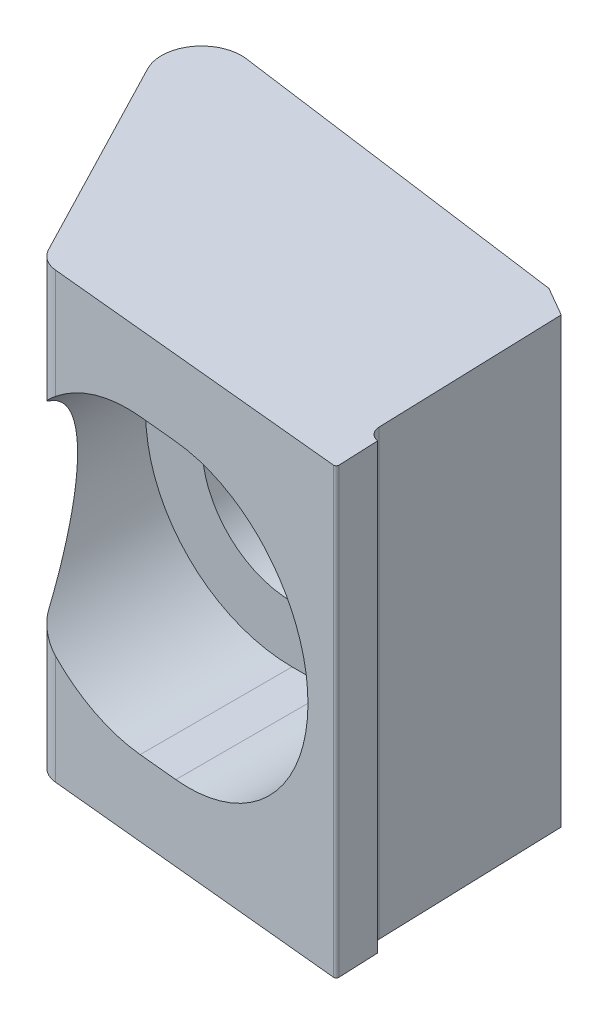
ISO-10303-21;
HEADER;
FILE_DESCRIPTION(('STEP AP214'),'2;1');
FILE_NAME('part.step','',(''),(''),'','','');
FILE_SCHEMA(('AUTOMOTIVE_DESIGN { 1 0 10303 214 1 1 1 1 }'));
ENDSEC;
DATA;
#1=APPLICATION_CONTEXT('core data for automotive mechanical design processes');
#2=APPLICATION_PROTOCOL_DEFINITION('international standard','automotive_design',2000,#1);
#3=PRODUCT_CONTEXT('',#1,'mechanical');
#4=PRODUCT('Part','Part','',(#3));
#5=PRODUCT_RELATED_PRODUCT_CATEGORY('part','',(#4));
#6=PRODUCT_DEFINITION_FORMATION('','',#4);
#7=PRODUCT_DEFINITION_CONTEXT('part definition',#1,'design');
#8=PRODUCT_DEFINITION('design','',#6,#7);
#9=PRODUCT_DEFINITION_SHAPE('','',#8);
#10=(LENGTH_UNIT() NAMED_UNIT(*) SI_UNIT(.MILLI.,.METRE.));
#11=(NAMED_UNIT(*) PLANE_ANGLE_UNIT() SI_UNIT($,.RADIAN.));
#12=(NAMED_UNIT(*) SI_UNIT($,.STERADIAN.) SOLID_ANGLE_UNIT());
#13=UNCERTAINTY_MEASURE_WITH_UNIT(LENGTH_MEASURE(1.E-05),#10,'distance_accuracy_value','');
#14=(GEOMETRIC_REPRESENTATION_CONTEXT(3) GLOBAL_UNCERTAINTY_ASSIGNED_CONTEXT((#13)) GLOBAL_UNIT_ASSIGNED_CONTEXT((#10,
#11,#12)) REPRESENTATION_CONTEXT('',''));
#15=CARTESIAN_POINT('',(0.,0.,0.));
#16=DIRECTION('',(0.,0.,1.));
#17=DIRECTION('',(1.,0.,0.));
#18=AXIS2_PLACEMENT_3D('',#15,#16,#17);
#19=CARTESIAN_POINT('',(-7.493,12.7,14.44498));
#20=DIRECTION('',(0.,-1.,0.));
#21=DIRECTION('',(1.,0.,0.));
#22=AXIS2_PLACEMENT_3D('',#19,#20,#21);
#23=CYLINDRICAL_SURFACE('',#22,1.524);
#24=DIRECTION('',(0.,-1.,0.));
#25=VECTOR('',#24,1.);
#26=CARTESIAN_POINT('',(-8.8454878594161,12.7,15.1473706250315));
#27=LINE('',#26,#25);
#28=CARTESIAN_POINT('',(-8.8454878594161,12.7,15.1473706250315));
#29=VERTEX_POINT('',#28);
#30=CARTESIAN_POINT('',(-8.8454878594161,5.18624872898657,15.1473706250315));
#31=VERTEX_POINT('',#30);
#32=EDGE_CURVE('E314',#29,#31,#27,.T.);
#33=ORIENTED_EDGE('',*,*,#32,.T.);
#34=CARTESIAN_POINT('',(-8.8454878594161,5.18624872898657,15.1473706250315));
#35=CARTESIAN_POINT('',(-8.81941307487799,5.21937150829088,15.1975027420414));
#36=CARTESIAN_POINT('',(-8.79124789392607,5.25460411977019,15.2449958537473));
#37=CARTESIAN_POINT('',(-8.73137862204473,5.32814622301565,15.3348842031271));
#38=CARTESIAN_POINT('',(-8.6996839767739,5.36644742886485,15.3772924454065));
#39=CARTESIAN_POINT('',(-8.6333369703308,5.44507142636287,15.4573517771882));
#40=CARTESIAN_POINT('',(-8.59869206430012,5.4853890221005,15.4950142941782));
#41=CARTESIAN_POINT('',(-8.52669325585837,5.5674933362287,15.5659672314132));
#42=CARTESIAN_POINT('',(-8.48933712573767,5.60928124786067,15.5992539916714));
#43=CARTESIAN_POINT('',(-8.40601788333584,5.70054040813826,15.6665700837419));
#44=CARTESIAN_POINT('',(-8.35963421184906,5.75017081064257,15.6998653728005));
#45=CARTESIAN_POINT('',(-8.26391263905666,5.85004025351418,15.7608424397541));
#46=CARTESIAN_POINT('',(-8.21457277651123,5.900279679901,15.788520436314));
#47=CARTESIAN_POINT('',(-8.06252363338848,6.05110302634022,15.8630601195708));
#48=CARTESIAN_POINT('',(-7.95566187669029,6.15192805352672,15.9015257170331));
#49=CARTESIAN_POINT('',(-7.81133381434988,6.28086894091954,15.9357567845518));
#50=CARTESIAN_POINT('',(-7.77756966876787,6.31054801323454,15.942575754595));
#51=CARTESIAN_POINT('',(-7.70943741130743,6.36946662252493,15.953926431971));
#52=CARTESIAN_POINT('',(-7.67507108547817,6.39870709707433,15.9584640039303));
#53=CARTESIAN_POINT('',(-7.6403832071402,6.42774117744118,15.9618366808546));
#54=B_SPLINE_CURVE_WITH_KNOTS('',3,(#34,#35,#36,#37,#38,#39,#40,#41,#42,#43,#44,#45,#46,#47,#48,
#49,#50,#51,#52,#53),.UNSPECIFIED.,.F.,.F.,(4,2,2,2,2,2,2,2,2,4),(0.,0.196205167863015,
0.391897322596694,0.587108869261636,0.782482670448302,1.00913033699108,1.23593007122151,
1.68891243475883,1.82527813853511,1.96129148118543),.UNSPECIFIED.);
#55=CARTESIAN_POINT('',(-7.64038320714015,6.42774117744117,15.9618366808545));
#56=VERTEX_POINT('',#55);
#57=EDGE_CURVE('E206',#31,#56,#54,.T.);
#58=ORIENTED_EDGE('',*,*,#57,.T.);
#59=DIRECTION('',(0.,-1.,0.));
#60=VECTOR('',#59,1.);
#61=CARTESIAN_POINT('',(-7.64038320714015,12.7,15.9618366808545));
#62=LINE('',#61,#60);
#63=CARTESIAN_POINT('',(-7.64038320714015,12.7,15.9618366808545));
#64=VERTEX_POINT('',#63);
#65=EDGE_CURVE('E310',#64,#56,#62,.T.);
#66=ORIENTED_EDGE('',*,*,#65,.F.);
#67=CARTESIAN_POINT('',(-7.493,12.7,14.44498));
#68=DIRECTION('',(0.,1.,0.));
#69=DIRECTION('',(-1.,0.,0.));
#70=AXIS2_PLACEMENT_3D('',#67,#68,#69);
#71=CIRCLE('',#70,1.524);
#72=EDGE_CURVE('E277',#29,#64,#71,.T.);
#73=ORIENTED_EDGE('',*,*,#72,.F.);
#74=EDGE_LOOP('',(#33,#58,#66,#73));
#75=FACE_BOUND('',#74,.T.);
#76=ADVANCED_FACE('F16',(#75),#23,.T.);
#77=CARTESIAN_POINT('',(7.40664,12.7,2.7432));
#78=DIRECTION('',(-0.134559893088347,0.,0.990905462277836));
#79=DIRECTION('',(0.990905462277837,0.,0.134559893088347));
#80=AXIS2_PLACEMENT_3D('',#77,#78,#79);
#81=PLANE('',#80);
#82=DIRECTION('',(-0.990905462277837,0.,-0.134559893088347));
#83=VECTOR('',#82,1.);
#84=CARTESIAN_POINT('',(7.40664,5.1562,2.7432));
#85=LINE('',#84,#83);
#86=CARTESIAN_POINT('',(0.,5.1562,1.7374161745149));
#87=VERTEX_POINT('',#86);
#88=CARTESIAN_POINT('',(-2.2606,5.1562,1.4304382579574));
#89=VERTEX_POINT('',#88);
#90=EDGE_CURVE('E184',#87,#89,#85,.T.);
#91=ORIENTED_EDGE('',*,*,#90,.T.);
#92=CARTESIAN_POINT('',(-2.2606,0.,1.4304382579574));
#93=DIRECTION('',(-0.134559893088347,0.,0.990905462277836));
#94=DIRECTION('',(0.990905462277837,0.,0.134559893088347));
#95=AXIS2_PLACEMENT_3D('',#92,#93,#94);
#96=ELLIPSE('',#95,5.2035236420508,5.1562);
#97=CARTESIAN_POINT('',(-2.2606,-5.1562,1.4304382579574));
#98=VERTEX_POINT('',#97);
#99=EDGE_CURVE('E187',#89,#98,#96,.T.);
#100=ORIENTED_EDGE('',*,*,#99,.T.);
#101=DIRECTION('',(0.990905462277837,0.,0.134559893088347));
#102=VECTOR('',#101,1.);
#103=CARTESIAN_POINT('',(7.40664,-5.1562,2.7432));
#104=LINE('',#103,#102);
#105=CARTESIAN_POINT('',(0.,-5.1562,1.7374161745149));
#106=VERTEX_POINT('',#105);
#107=EDGE_CURVE('E179',#98,#106,#104,.T.);
#108=ORIENTED_EDGE('',*,*,#107,.T.);
#109=CARTESIAN_POINT('',(0.,0.,1.7374161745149));
#110=DIRECTION('',(-0.134559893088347,0.,0.990905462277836));
#111=DIRECTION('',(0.990905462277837,0.,0.134559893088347));
#112=AXIS2_PLACEMENT_3D('',#109,#110,#111);
#113=ELLIPSE('',#112,5.2035236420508,5.1562);
#114=EDGE_CURVE('E159',#106,#87,#113,.T.);
#115=ORIENTED_EDGE('',*,*,#114,.T.);
#116=EDGE_LOOP('',(#91,#100,#108,#115));
#117=FACE_BOUND('',#116,.T.);
#118=DIRECTION('',(-0.990905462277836,0.,-0.134559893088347));
#119=VECTOR('',#118,1.);
#120=CARTESIAN_POINT('',(7.40664,-12.7,2.7432));
#121=LINE('',#120,#119);
#122=CARTESIAN_POINT('',(7.40664,-12.7,2.7432));
#123=VERTEX_POINT('',#122);
#124=CARTESIAN_POINT('',(-12.6413160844,-12.7,0.0207901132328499));
#125=VERTEX_POINT('',#124);
#126=EDGE_CURVE('E247',#123,#125,#121,.T.);
#127=ORIENTED_EDGE('',*,*,#126,.T.);
#128=DIRECTION('',(0.,-1.,0.));
#129=VECTOR('',#128,1.);
#130=CARTESIAN_POINT('',(-12.6413160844,12.7,0.0207901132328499));
#131=LINE('',#130,#129);
#132=CARTESIAN_POINT('',(-12.6413160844,12.7,0.0207901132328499));
#133=VERTEX_POINT('',#132);
#134=EDGE_CURVE('E320',#133,#125,#131,.T.);
#135=ORIENTED_EDGE('',*,*,#134,.F.);
#136=DIRECTION('',(-0.990905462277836,0.,-0.134559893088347));
#137=VECTOR('',#136,1.);
#138=CARTESIAN_POINT('',(7.40664,12.7,2.7432));
#139=LINE('',#138,#137);
#140=CARTESIAN_POINT('',(7.40664,12.7,2.7432));
#141=VERTEX_POINT('',#140);
#142=EDGE_CURVE('E270',#141,#133,#139,.T.);
#143=ORIENTED_EDGE('',*,*,#142,.F.);
#144=DIRECTION('',(0.,-1.,0.));
#145=VECTOR('',#144,1.);
#146=CARTESIAN_POINT('',(7.40664,12.7,2.7432));
#147=LINE('',#146,#145);
#148=EDGE_CURVE('E291',#141,#123,#147,.T.);
#149=ORIENTED_EDGE('',*,*,#148,.T.);
#150=EDGE_LOOP('',(#127,#135,#143,#149));
#151=FACE_BOUND('',#150,.T.);
#152=ADVANCED_FACE('F18',(#117,#151),#81,.F.);
#153=CARTESIAN_POINT('',(-12.94892,12.7,2.286));
#154=DIRECTION('',(0.,-1.,0.));
#155=DIRECTION('',(1.,0.,0.));
#156=AXIS2_PLACEMENT_3D('',#153,#154,#155);
#157=CYLINDRICAL_SURFACE('',#156,2.286);
#158=CARTESIAN_POINT('',(-12.94892,-12.7,2.286));
#159=DIRECTION('',(0.,1.,0.));
#160=DIRECTION('',(-1.,0.,0.));
#161=AXIS2_PLACEMENT_3D('',#158,#159,#160);
#162=CIRCLE('',#161,2.286);
#163=CARTESIAN_POINT('',(-14.9776517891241,-12.7,3.33958593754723));
#164=VERTEX_POINT('',#163);
#165=EDGE_CURVE('E250',#125,#164,#162,.T.);
#166=ORIENTED_EDGE('',*,*,#165,.T.);
#167=DIRECTION('',(0.,-1.,0.));
#168=VECTOR('',#167,1.);
#169=CARTESIAN_POINT('',(-14.9776517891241,12.7,3.33958593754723));
#170=LINE('',#169,#168);
#171=CARTESIAN_POINT('',(-14.9776517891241,12.7,3.33958593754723));
#172=VERTEX_POINT('',#171);
#173=EDGE_CURVE('E317',#172,#164,#170,.T.);
#174=ORIENTED_EDGE('',*,*,#173,.F.);
#175=CARTESIAN_POINT('',(-12.94892,12.7,2.286));
#176=DIRECTION('',(0.,1.,0.));
#177=DIRECTION('',(-1.,0.,0.));
#178=AXIS2_PLACEMENT_3D('',#175,#176,#177);
#179=CIRCLE('',#178,2.286);
#180=EDGE_CURVE('E273',#133,#172,#179,.T.);
#181=ORIENTED_EDGE('',*,*,#180,.F.);
#182=ORIENTED_EDGE('',*,*,#134,.T.);
#183=EDGE_LOOP('',(#166,#174,#181,#182));
#184=FACE_BOUND('',#183,.T.);
#185=ADVANCED_FACE('F370',(#184),#157,.T.);
#186=CARTESIAN_POINT('',(-8.8454878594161,12.7,15.1473706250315));
#187=DIRECTION('',(0.887459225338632,0.,-0.460886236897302));
#188=DIRECTION('',(-0.460886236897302,0.,-0.887459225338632));
#189=AXIS2_PLACEMENT_3D('',#186,#187,#188);
#190=PLANE('',#189);
#191=CARTESIAN_POINT('',(-8.8454878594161,-5.18624872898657,15.1473706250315));
#192=VERTEX_POINT('',#191);
#193=CARTESIAN_POINT('',(-8.8454878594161,-12.7,15.1473706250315));
#194=VERTEX_POINT('',#193);
#195=EDGE_CURVE('E313',#192,#194,#27,.T.);
#196=ORIENTED_EDGE('',*,*,#195,.F.);
#197=CARTESIAN_POINT('',(-2.2606,0.,27.8268976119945));
#198=DIRECTION('',(0.887459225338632,0.,-0.460886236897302));
#199=DIRECTION('',(0.460886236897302,0.,0.887459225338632));
#200=AXIS2_PLACEMENT_3D('',#197,#198,#199);
#201=ELLIPSE('',#200,18.1867005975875,8.382);
#202=EDGE_CURVE('E222',#192,#31,#201,.T.);
#203=ORIENTED_EDGE('',*,*,#202,.T.);
#204=ORIENTED_EDGE('',*,*,#32,.F.);
#205=DIRECTION('',(0.460886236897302,0.,0.887459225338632));
#206=VECTOR('',#205,1.);
#207=CARTESIAN_POINT('',(-8.8454878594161,12.7,15.1473706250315));
#208=LINE('',#207,#206);
#209=EDGE_CURVE('E275',#172,#29,#208,.T.);
#210=ORIENTED_EDGE('',*,*,#209,.F.);
#211=ORIENTED_EDGE('',*,*,#173,.T.);
#212=DIRECTION('',(0.460886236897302,0.,0.887459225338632));
#213=VECTOR('',#212,1.);
#214=CARTESIAN_POINT('',(-8.8454878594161,-12.7,15.1473706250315));
#215=LINE('',#214,#213);
#216=EDGE_CURVE('E252',#164,#194,#215,.T.);
#217=ORIENTED_EDGE('',*,*,#216,.T.);
#218=EDGE_LOOP('',(#196,#203,#204,#210,#211,#217));
#219=FACE_BOUND('',#218,.T.);
#220=ADVANCED_FACE('F343',(#219),#190,.F.);
#221=CARTESIAN_POINT('',(-7.64038320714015,-6.42774117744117,15.9618366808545));
#222=VERTEX_POINT('',#221);
#223=CARTESIAN_POINT('',(-7.64038320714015,-12.7,15.9618366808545));
#224=VERTEX_POINT('',#223);
#225=EDGE_CURVE('E309',#222,#224,#62,.T.);
#226=ORIENTED_EDGE('',*,*,#225,.F.);
#227=CARTESIAN_POINT('',(-7.64038320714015,-6.42774117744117,15.9618366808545));
#228=CARTESIAN_POINT('',(-7.6893859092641,-6.38673008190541,15.9570669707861));
#229=CARTESIAN_POINT('',(-7.73775178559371,-6.34529333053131,15.9499796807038));
#230=CARTESIAN_POINT('',(-7.83303250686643,-6.26178337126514,15.9313564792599));
#231=CARTESIAN_POINT('',(-7.8799477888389,-6.21971036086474,15.9198219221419));
#232=CARTESIAN_POINT('',(-8.0193465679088,-6.09185761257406,15.8785090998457));
#233=CARTESIAN_POINT('',(-8.10935923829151,-6.00538719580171,15.8421375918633));
#234=CARTESIAN_POINT('',(-8.24512719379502,-5.8692741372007,15.7716433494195));
#235=CARTESIAN_POINT('',(-8.29360406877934,-5.81940382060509,15.7429814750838));
#236=CARTESIAN_POINT('',(-8.38757613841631,-5.72037855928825,15.6800928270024));
#237=CARTESIAN_POINT('',(-8.43307275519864,-5.67122328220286,15.6458687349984));
#238=CARTESIAN_POINT('',(-8.52050435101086,-5.57456239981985,15.571953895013));
#239=CARTESIAN_POINT('',(-8.56245905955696,-5.52704866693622,15.5322971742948));
#240=CARTESIAN_POINT('',(-8.64265166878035,-5.43425165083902,15.4471248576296));
#241=CARTESIAN_POINT('',(-8.68089359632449,-5.38896597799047,15.4016157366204));
#242=CARTESIAN_POINT('',(-8.74036008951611,-5.31714006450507,15.3214556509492));
#243=CARTESIAN_POINT('',(-8.76283737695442,-5.28961126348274,15.2886193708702));
#244=CARTESIAN_POINT('',(-8.80576186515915,-5.23640740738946,15.2201318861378));
#245=CARTESIAN_POINT('',(-8.82620570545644,-5.21073543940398,15.1844761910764));
#246=CARTESIAN_POINT('',(-8.8454878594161,-5.18624872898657,15.1473706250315));
#247=B_SPLINE_CURVE_WITH_KNOTS('',3,(#227,#228,#229,#230,#231,#232,#233,#234,#235,#236,#237,
#238,#239,#240,#241,#242,#243,#244,#245,#246),.UNSPECIFIED.,.F.,.F.,(4,2,2,2,2,2,2,2,2,4),(0.,
0.192108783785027,0.384159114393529,0.772634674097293,0.998095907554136,1.22344875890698,
1.44744967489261,1.67120486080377,1.81621942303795,1.96146978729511),.UNSPECIFIED.);
#248=EDGE_CURVE('E240',#222,#192,#247,.T.);
#249=ORIENTED_EDGE('',*,*,#248,.T.);
#250=ORIENTED_EDGE('',*,*,#195,.T.);
#251=CARTESIAN_POINT('',(-7.493,-12.7,14.44498));
#252=DIRECTION('',(0.,1.,0.));
#253=DIRECTION('',(-1.,0.,0.));
#254=AXIS2_PLACEMENT_3D('',#251,#252,#253);
#255=CIRCLE('',#254,1.524);
#256=EDGE_CURVE('E255',#194,#224,#255,.T.);
#257=ORIENTED_EDGE('',*,*,#256,.T.);
#258=EDGE_LOOP('',(#226,#249,#250,#257));
#259=FACE_BOUND('',#258,.T.);
#260=ADVANCED_FACE('F224',(#259),#23,.T.);
#261=CARTESIAN_POINT('',(9.99286167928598,12.7,17.6751456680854));
#262=DIRECTION('',(0.0967081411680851,0.,-0.995312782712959));
#263=DIRECTION('',(-0.995312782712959,0.,-0.0967081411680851));
#264=AXIS2_PLACEMENT_3D('',#261,#262,#263);
#265=PLANE('',#264);
#266=DIRECTION('',(-0.995312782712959,0.,-0.0967081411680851));
#267=VECTOR('',#266,1.);
#268=CARTESIAN_POINT('',(9.99286167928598,-8.382,17.6751456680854));
#269=LINE('',#268,#267);
#270=CARTESIAN_POINT('',(0.,-8.382,16.7042035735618));
#271=VERTEX_POINT('',#270);
#272=CARTESIAN_POINT('',(-2.2606,-8.382,16.4845556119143));
#273=VERTEX_POINT('',#272);
#274=EDGE_CURVE('E323',#271,#273,#269,.T.);
#275=ORIENTED_EDGE('',*,*,#274,.T.);
#276=CARTESIAN_POINT('',(-2.2606,0.,16.4845556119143));
#277=DIRECTION('',(0.0967081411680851,0.,-0.995312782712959));
#278=DIRECTION('',(0.995312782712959,0.,0.0967081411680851));
#279=AXIS2_PLACEMENT_3D('',#276,#277,#278);
#280=ELLIPSE('',#279,8.42147327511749,8.382);
#281=EDGE_CURVE('E11',#273,#222,#280,.T.);
#282=ORIENTED_EDGE('',*,*,#281,.T.);
#283=ORIENTED_EDGE('',*,*,#225,.T.);
#284=DIRECTION('',(0.995312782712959,0.,0.0967081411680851));
#285=VECTOR('',#284,1.);
#286=CARTESIAN_POINT('',(9.99286167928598,-12.7,17.6751456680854));
#287=LINE('',#286,#285);
#288=CARTESIAN_POINT('',(9.99286167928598,-12.7,17.6751456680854));
#289=VERTEX_POINT('',#288);
#290=EDGE_CURVE('E258',#224,#289,#287,.T.);
#291=ORIENTED_EDGE('',*,*,#290,.T.);
#292=DIRECTION('',(0.,-1.,0.));
#293=VECTOR('',#292,1.);
#294=CARTESIAN_POINT('',(9.99286167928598,12.7,17.6751456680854));
#295=LINE('',#294,#293);
#296=CARTESIAN_POINT('',(9.99286167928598,12.7,17.6751456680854));
#297=VERTEX_POINT('',#296);
#298=EDGE_CURVE('E306',#297,#289,#295,.T.);
#299=ORIENTED_EDGE('',*,*,#298,.F.);
#300=DIRECTION('',(0.995312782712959,0.,0.0967081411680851));
#301=VECTOR('',#300,1.);
#302=CARTESIAN_POINT('',(9.99286167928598,12.7,17.6751456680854));
#303=LINE('',#302,#301);
#304=EDGE_CURVE('E279',#64,#297,#303,.T.);
#305=ORIENTED_EDGE('',*,*,#304,.F.);
#306=ORIENTED_EDGE('',*,*,#65,.T.);
#307=CARTESIAN_POINT('',(-2.2606,8.382,16.4845556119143));
#308=VERTEX_POINT('',#307);
#309=EDGE_CURVE('E20',#56,#308,#280,.T.);
#310=ORIENTED_EDGE('',*,*,#309,.T.);
#311=DIRECTION('',(0.995312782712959,0.,0.0967081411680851));
#312=VECTOR('',#311,1.);
#313=CARTESIAN_POINT('',(9.99286167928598,8.382,17.6751456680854));
#314=LINE('',#313,#312);
#315=CARTESIAN_POINT('',(0.,8.382,16.7042035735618));
#316=VERTEX_POINT('',#315);
#317=EDGE_CURVE('E328',#308,#316,#314,.T.);
#318=ORIENTED_EDGE('',*,*,#317,.T.);
#319=CARTESIAN_POINT('',(0.,0.,16.7042035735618));
#320=DIRECTION('',(0.0967081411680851,0.,-0.995312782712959));
#321=DIRECTION('',(0.995312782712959,0.,0.0967081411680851));
#322=AXIS2_PLACEMENT_3D('',#319,#320,#321);
#323=ELLIPSE('',#322,8.42147327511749,8.382);
#324=EDGE_CURVE('E326',#316,#271,#323,.T.);
#325=ORIENTED_EDGE('',*,*,#324,.T.);
#326=EDGE_LOOP('',(#275,#282,#283,#291,#299,#305,#306,#310,#318,#325));
#327=FACE_BOUND('',#326,.T.);
#328=ADVANCED_FACE('F332',(#327),#265,.F.);
#329=CARTESIAN_POINT('',(10.0076,12.7,17.52346));
#330=DIRECTION('',(0.,-1.,0.));
#331=DIRECTION('',(1.,0.,0.));
#332=AXIS2_PLACEMENT_3D('',#329,#330,#331);
#333=CYLINDRICAL_SURFACE('',#332,0.1524);
#334=CARTESIAN_POINT('',(10.0076,-12.7,17.52346));
#335=DIRECTION('',(0.,1.,0.));
#336=DIRECTION('',(-1.,0.,0.));
#337=AXIS2_PLACEMENT_3D('',#334,#335,#336);
#338=CIRCLE('',#337,0.1524);
#339=CARTESIAN_POINT('',(10.1598606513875,-12.7,17.5169443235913));
#340=VERTEX_POINT('',#339);
#341=EDGE_CURVE('E260',#289,#340,#338,.T.);
#342=ORIENTED_EDGE('',*,*,#341,.T.);
#343=DIRECTION('',(0.,-1.,0.));
#344=VECTOR('',#343,1.);
#345=CARTESIAN_POINT('',(10.1598606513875,12.7,17.5169443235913));
#346=LINE('',#345,#344);
#347=CARTESIAN_POINT('',(10.1598606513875,12.7,17.5169443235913));
#348=VERTEX_POINT('',#347);
#349=EDGE_CURVE('E303',#348,#340,#346,.T.);
#350=ORIENTED_EDGE('',*,*,#349,.F.);
#351=CARTESIAN_POINT('',(10.0076,12.7,17.52346));
#352=DIRECTION('',(0.,1.,0.));
#353=DIRECTION('',(-1.,0.,0.));
#354=AXIS2_PLACEMENT_3D('',#351,#352,#353);
#355=CIRCLE('',#354,0.1524);
#356=EDGE_CURVE('E281',#297,#348,#355,.T.);
#357=ORIENTED_EDGE('',*,*,#356,.F.);
#358=ORIENTED_EDGE('',*,*,#298,.T.);
#359=EDGE_LOOP('',(#342,#350,#357,#358));
#360=FACE_BOUND('',#359,.T.);
#361=ADVANCED_FACE('F378',(#360),#333,.T.);
#362=CARTESIAN_POINT('',(10.1598606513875,12.7,17.5169443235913));
#363=DIRECTION('',(-0.999085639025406,0.,0.0427537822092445));
#364=DIRECTION('',(0.0427537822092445,0.,0.999085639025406));
#365=AXIS2_PLACEMENT_3D('',#362,#363,#364);
#366=PLANE('',#365);
#367=DIRECTION('',(-0.0427537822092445,0.,-0.999085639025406));
#368=VECTOR('',#367,1.);
#369=CARTESIAN_POINT('',(10.1598606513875,-12.7,17.5169443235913));
#370=LINE('',#369,#368);
#371=CARTESIAN_POINT('',(10.0610433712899,-12.7,15.2077468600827));
#372=VERTEX_POINT('',#371);
#373=EDGE_CURVE('E262',#340,#372,#370,.T.);
#374=ORIENTED_EDGE('',*,*,#373,.T.);
#375=DIRECTION('',(0.,-1.,0.));
#376=VECTOR('',#375,1.);
#377=CARTESIAN_POINT('',(10.0610433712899,12.7,15.2077468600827));
#378=LINE('',#377,#376);
#379=CARTESIAN_POINT('',(10.0610433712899,12.7,15.2077468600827));
#380=VERTEX_POINT('',#379);
#381=EDGE_CURVE('E300',#380,#372,#378,.T.);
#382=ORIENTED_EDGE('',*,*,#381,.F.);
#383=DIRECTION('',(-0.0427537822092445,0.,-0.999085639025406));
#384=VECTOR('',#383,1.);
#385=CARTESIAN_POINT('',(10.1598606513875,12.7,17.5169443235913));
#386=LINE('',#385,#384);
#387=EDGE_CURVE('E283',#348,#380,#386,.T.);
#388=ORIENTED_EDGE('',*,*,#387,.F.);
#389=ORIENTED_EDGE('',*,*,#349,.T.);
#390=EDGE_LOOP('',(#374,#382,#388,#389));
#391=FACE_BOUND('',#390,.T.);
#392=ADVANCED_FACE('F400',(#391),#366,.F.);
#393=CARTESIAN_POINT('',(10.18032,12.7,14.45514));
#394=DIRECTION('',(0.,-1.,0.));
#395=DIRECTION('',(1.,0.,0.));
#396=AXIS2_PLACEMENT_3D('',#393,#394,#395);
#397=CYLINDRICAL_SURFACE('',#396,0.762);
#398=CARTESIAN_POINT('',(10.18032,-12.7,14.45514));
#399=DIRECTION('',(0.,-1.,0.));
#400=DIRECTION('',(-1.,0.,0.));
#401=AXIS2_PLACEMENT_3D('',#398,#399,#400);
#402=CIRCLE('',#401,0.762);
#403=CARTESIAN_POINT('',(9.41871805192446,-12.7,14.4797666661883));
#404=VERTEX_POINT('',#403);
#405=EDGE_CURVE('E264',#372,#404,#402,.T.);
#406=ORIENTED_EDGE('',*,*,#405,.T.);
#407=DIRECTION('',(0.,-1.,0.));
#408=VECTOR('',#407,1.);
#409=CARTESIAN_POINT('',(9.41871805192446,12.7,14.4797666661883));
#410=LINE('',#409,#408);
#411=CARTESIAN_POINT('',(9.41871805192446,12.7,14.4797666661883));
#412=VERTEX_POINT('',#411);
#413=EDGE_CURVE('E297',#412,#404,#410,.T.);
#414=ORIENTED_EDGE('',*,*,#413,.F.);
#415=CARTESIAN_POINT('',(10.18032,12.7,14.45514));
#416=DIRECTION('',(0.,-1.,0.));
#417=DIRECTION('',(-1.,0.,0.));
#418=AXIS2_PLACEMENT_3D('',#415,#416,#417);
#419=CIRCLE('',#418,0.762);
#420=EDGE_CURVE('E285',#380,#412,#419,.T.);
#421=ORIENTED_EDGE('',*,*,#420,.F.);
#422=ORIENTED_EDGE('',*,*,#381,.T.);
#423=EDGE_LOOP('',(#406,#414,#421,#422));
#424=FACE_BOUND('',#423,.T.);
#425=ADVANCED_FACE('F419',(#424),#397,.F.);
#426=CARTESIAN_POINT('',(9.41871805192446,12.7,14.4797666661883));
#427=DIRECTION('',(-0.99947762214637,0.,0.0323184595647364));
#428=DIRECTION('',(0.0323184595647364,0.,0.99947762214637));
#429=AXIS2_PLACEMENT_3D('',#426,#427,#428);
#430=PLANE('',#429);
#431=DIRECTION('',(-0.0323184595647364,0.,-0.99947762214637));
#432=VECTOR('',#431,1.);
#433=CARTESIAN_POINT('',(9.41871805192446,-12.7,14.4797666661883));
#434=LINE('',#433,#432);
#435=CARTESIAN_POINT('',(9.07034,-12.7,3.70586));
#436=VERTEX_POINT('',#435);
#437=EDGE_CURVE('E266',#404,#436,#434,.T.);
#438=ORIENTED_EDGE('',*,*,#437,.T.);
#439=DIRECTION('',(0.,-1.,0.));
#440=VECTOR('',#439,1.);
#441=CARTESIAN_POINT('',(9.07034,12.7,3.70586));
#442=LINE('',#441,#440);
#443=CARTESIAN_POINT('',(9.07034,12.7,3.70586));
#444=VERTEX_POINT('',#443);
#445=EDGE_CURVE('E294',#444,#436,#442,.T.);
#446=ORIENTED_EDGE('',*,*,#445,.F.);
#447=DIRECTION('',(-0.0323184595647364,0.,-0.99947762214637));
#448=VECTOR('',#447,1.);
#449=CARTESIAN_POINT('',(9.41871805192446,12.7,14.4797666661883));
#450=LINE('',#449,#448);
#451=EDGE_CURVE('E287',#412,#444,#450,.T.);
#452=ORIENTED_EDGE('',*,*,#451,.F.);
#453=ORIENTED_EDGE('',*,*,#413,.T.);
#454=EDGE_LOOP('',(#438,#446,#452,#453));
#455=FACE_BOUND('',#454,.T.);
#456=ADVANCED_FACE('F417',(#455),#430,.F.);
#457=CARTESIAN_POINT('',(9.07034,12.7,3.70586));
#458=DIRECTION('',(-0.500827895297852,0.,0.865546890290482));
#459=DIRECTION('',(0.865546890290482,0.,0.500827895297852));
#460=AXIS2_PLACEMENT_3D('',#457,#458,#459);
#461=PLANE('',#460);
#462=DIRECTION('',(-0.865546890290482,0.,-0.500827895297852));
#463=VECTOR('',#462,1.);
#464=CARTESIAN_POINT('',(9.07034,-12.7,3.70586));
#465=LINE('',#464,#463);
#466=EDGE_CURVE('E268',#436,#123,#465,.T.);
#467=ORIENTED_EDGE('',*,*,#466,.T.);
#468=ORIENTED_EDGE('',*,*,#148,.F.);
#469=DIRECTION('',(-0.865546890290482,0.,-0.500827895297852));
#470=VECTOR('',#469,1.);
#471=CARTESIAN_POINT('',(9.07034,12.7,3.70586));
#472=LINE('',#471,#470);
#473=EDGE_CURVE('E289',#444,#141,#472,.T.);
#474=ORIENTED_EDGE('',*,*,#473,.F.);
#475=ORIENTED_EDGE('',*,*,#445,.T.);
#476=EDGE_LOOP('',(#467,#468,#474,#475));
#477=FACE_BOUND('',#476,.T.);
#478=ADVANCED_FACE('F413',(#477),#461,.F.);
#479=CARTESIAN_POINT('',(-12.94892,12.7,2.286));
#480=DIRECTION('',(0.,1.,0.));
#481=DIRECTION('',(-1.,0.,0.));
#482=AXIS2_PLACEMENT_3D('',#479,#480,#481);
#483=PLANE('',#482);
#484=ORIENTED_EDGE('',*,*,#142,.T.);
#485=ORIENTED_EDGE('',*,*,#180,.T.);
#486=ORIENTED_EDGE('',*,*,#209,.T.);
#487=ORIENTED_EDGE('',*,*,#72,.T.);
#488=ORIENTED_EDGE('',*,*,#304,.T.);
#489=ORIENTED_EDGE('',*,*,#356,.T.);
#490=ORIENTED_EDGE('',*,*,#387,.T.);
#491=ORIENTED_EDGE('',*,*,#420,.T.);
#492=ORIENTED_EDGE('',*,*,#451,.T.);
#493=ORIENTED_EDGE('',*,*,#473,.T.);
#494=EDGE_LOOP('',(#484,#485,#486,#487,#488,#489,#490,#491,#492,#493));
#495=FACE_BOUND('',#494,.T.);
#496=ADVANCED_FACE('F404',(#495),#483,.T.);
#497=CARTESIAN_POINT('',(-12.94892,-12.7,2.286));
#498=DIRECTION('',(0.,1.,0.));
#499=DIRECTION('',(-1.,0.,0.));
#500=AXIS2_PLACEMENT_3D('',#497,#498,#499);
#501=PLANE('',#500);
#502=ORIENTED_EDGE('',*,*,#126,.F.);
#503=ORIENTED_EDGE('',*,*,#466,.F.);
#504=ORIENTED_EDGE('',*,*,#437,.F.);
#505=ORIENTED_EDGE('',*,*,#405,.F.);
#506=ORIENTED_EDGE('',*,*,#373,.F.);
#507=ORIENTED_EDGE('',*,*,#341,.F.);
#508=ORIENTED_EDGE('',*,*,#290,.F.);
#509=ORIENTED_EDGE('',*,*,#256,.F.);
#510=ORIENTED_EDGE('',*,*,#216,.F.);
#511=ORIENTED_EDGE('',*,*,#165,.F.);
#512=EDGE_LOOP('',(#502,#503,#504,#505,#506,#507,#508,#509,#510,#511));
#513=FACE_BOUND('',#512,.T.);
#514=ADVANCED_FACE('F234',(#513),#501,.F.);
#515=CARTESIAN_POINT('',(-2.2606,0.,7.7851));
#516=DIRECTION('',(0.,0.,1.));
#517=DIRECTION('',(0.,1.,0.));
#518=AXIS2_PLACEMENT_3D('',#515,#516,#517);
#519=CYLINDRICAL_SURFACE('',#518,8.382);
#520=DIRECTION('',(0.,0.,1.));
#521=VECTOR('',#520,1.);
#522=CARTESIAN_POINT('',(-2.2606,-8.382,7.7851));
#523=LINE('',#522,#521);
#524=CARTESIAN_POINT('',(-2.2606,-8.382,7.7851));
#525=VERTEX_POINT('',#524);
#526=EDGE_CURVE('E202',#525,#273,#523,.T.);
#527=ORIENTED_EDGE('',*,*,#526,.F.);
#528=CARTESIAN_POINT('',(-2.2606,0.,7.7851));
#529=DIRECTION('',(0.,0.,1.));
#530=DIRECTION('',(0.,1.,0.));
#531=AXIS2_PLACEMENT_3D('',#528,#529,#530);
#532=CIRCLE('',#531,8.382);
#533=CARTESIAN_POINT('',(-2.2606,8.382,7.7851));
#534=VERTEX_POINT('',#533);
#535=EDGE_CURVE('E190',#534,#525,#532,.T.);
#536=ORIENTED_EDGE('',*,*,#535,.F.);
#537=DIRECTION('',(0.,0.,1.));
#538=VECTOR('',#537,1.);
#539=CARTESIAN_POINT('',(-2.2606,8.382,7.7851));
#540=LINE('',#539,#538);
#541=EDGE_CURVE('E203',#534,#308,#540,.T.);
#542=ORIENTED_EDGE('',*,*,#541,.T.);
#543=ORIENTED_EDGE('',*,*,#309,.F.);
#544=ORIENTED_EDGE('',*,*,#57,.F.);
#545=ORIENTED_EDGE('',*,*,#202,.F.);
#546=ORIENTED_EDGE('',*,*,#248,.F.);
#547=ORIENTED_EDGE('',*,*,#281,.F.);
#548=EDGE_LOOP('',(#527,#536,#542,#543,#544,#545,#546,#547));
#549=FACE_BOUND('',#548,.T.);
#550=ADVANCED_FACE('F228',(#549),#519,.F.);
#551=CARTESIAN_POINT('',(-2.2606,8.382,7.7851));
#552=DIRECTION('',(0.,1.,0.));
#553=DIRECTION('',(-1.,0.,0.));
#554=AXIS2_PLACEMENT_3D('',#551,#552,#553);
#555=PLANE('',#554);
#556=ORIENTED_EDGE('',*,*,#541,.F.);
#557=DIRECTION('',(-1.,0.,0.));
#558=VECTOR('',#557,1.);
#559=CARTESIAN_POINT('',(-2.2606,8.382,7.7851));
#560=LINE('',#559,#558);
#561=CARTESIAN_POINT('',(0.,8.382,7.7851));
#562=VERTEX_POINT('',#561);
#563=EDGE_CURVE('E199',#562,#534,#560,.T.);
#564=ORIENTED_EDGE('',*,*,#563,.F.);
#565=DIRECTION('',(0.,0.,1.));
#566=VECTOR('',#565,1.);
#567=CARTESIAN_POINT('',(0.,8.382,7.7851));
#568=LINE('',#567,#566);
#569=EDGE_CURVE('E207',#562,#316,#568,.T.);
#570=ORIENTED_EDGE('',*,*,#569,.T.);
#571=ORIENTED_EDGE('',*,*,#317,.F.);
#572=EDGE_LOOP('',(#556,#564,#570,#571));
#573=FACE_BOUND('',#572,.T.);
#574=ADVANCED_FACE('F233',(#573),#555,.F.);
#575=CARTESIAN_POINT('',(0.,0.,7.7851));
#576=DIRECTION('',(0.,0.,1.));
#577=DIRECTION('',(0.,1.,0.));
#578=AXIS2_PLACEMENT_3D('',#575,#576,#577);
#579=CYLINDRICAL_SURFACE('',#578,8.382);
#580=ORIENTED_EDGE('',*,*,#569,.F.);
#581=CARTESIAN_POINT('',(0.,0.,7.7851));
#582=DIRECTION('',(0.,0.,1.));
#583=DIRECTION('',(0.,1.,0.));
#584=AXIS2_PLACEMENT_3D('',#581,#582,#583);
#585=CIRCLE('',#584,8.382);
#586=CARTESIAN_POINT('',(0.,-8.382,7.7851));
#587=VERTEX_POINT('',#586);
#588=EDGE_CURVE('E196',#587,#562,#585,.T.);
#589=ORIENTED_EDGE('',*,*,#588,.F.);
#590=DIRECTION('',(0.,0.,1.));
#591=VECTOR('',#590,1.);
#592=CARTESIAN_POINT('',(0.,-8.382,7.7851));
#593=LINE('',#592,#591);
#594=EDGE_CURVE('E210',#587,#271,#593,.T.);
#595=ORIENTED_EDGE('',*,*,#594,.T.);
#596=ORIENTED_EDGE('',*,*,#324,.F.);
#597=EDGE_LOOP('',(#580,#589,#595,#596));
#598=FACE_BOUND('',#597,.T.);
#599=ADVANCED_FACE('F356',(#598),#579,.F.);
#600=CARTESIAN_POINT('',(0.,-8.382,7.7851));
#601=DIRECTION('',(0.,-1.,0.));
#602=DIRECTION('',(1.,0.,0.));
#603=AXIS2_PLACEMENT_3D('',#600,#601,#602);
#604=PLANE('',#603);
#605=ORIENTED_EDGE('',*,*,#594,.F.);
#606=DIRECTION('',(1.,0.,0.));
#607=VECTOR('',#606,1.);
#608=CARTESIAN_POINT('',(0.,-8.382,7.7851));
#609=LINE('',#608,#607);
#610=EDGE_CURVE('E193',#525,#587,#609,.T.);
#611=ORIENTED_EDGE('',*,*,#610,.F.);
#612=ORIENTED_EDGE('',*,*,#526,.T.);
#613=ORIENTED_EDGE('',*,*,#274,.F.);
#614=EDGE_LOOP('',(#605,#611,#612,#613));
#615=FACE_BOUND('',#614,.T.);
#616=ADVANCED_FACE('F236',(#615),#604,.F.);
#617=CARTESIAN_POINT('',(-2.2606,0.,7.7851));
#618=DIRECTION('',(0.,0.,1.));
#619=DIRECTION('',(0.,1.,0.));
#620=AXIS2_PLACEMENT_3D('',#617,#618,#619);
#621=PLANE('',#620);
#622=CARTESIAN_POINT('',(-2.2606,0.,7.7851));
#623=DIRECTION('',(0.,0.,1.));
#624=DIRECTION('',(0.,1.,0.));
#625=AXIS2_PLACEMENT_3D('',#622,#623,#624);
#626=CIRCLE('',#625,5.1562);
#627=CARTESIAN_POINT('',(-2.2606,5.1562,7.7851));
#628=VERTEX_POINT('',#627);
#629=CARTESIAN_POINT('',(-2.2606,-5.1562,7.7851));
#630=VERTEX_POINT('',#629);
#631=EDGE_CURVE('E39',#628,#630,#626,.T.);
#632=ORIENTED_EDGE('',*,*,#631,.F.);
#633=DIRECTION('',(-1.,0.,0.));
#634=VECTOR('',#633,1.);
#635=CARTESIAN_POINT('',(0.,5.1562,7.7851));
#636=LINE('',#635,#634);
#637=CARTESIAN_POINT('',(0.,5.1562,7.7851));
#638=VERTEX_POINT('',#637);
#639=EDGE_CURVE('E172',#638,#628,#636,.T.);
#640=ORIENTED_EDGE('',*,*,#639,.F.);
#641=CARTESIAN_POINT('',(0.,0.,7.7851));
#642=DIRECTION('',(0.,0.,1.));
#643=DIRECTION('',(0.,1.,0.));
#644=AXIS2_PLACEMENT_3D('',#641,#642,#643);
#645=CIRCLE('',#644,5.1562);
#646=CARTESIAN_POINT('',(0.,-5.1562,7.7851));
#647=VERTEX_POINT('',#646);
#648=EDGE_CURVE('E156',#647,#638,#645,.T.);
#649=ORIENTED_EDGE('',*,*,#648,.F.);
#650=DIRECTION('',(1.,0.,0.));
#651=VECTOR('',#650,1.);
#652=CARTESIAN_POINT('',(-2.2606,-5.1562,7.7851));
#653=LINE('',#652,#651);
#654=EDGE_CURVE('E165',#630,#647,#653,.T.);
#655=ORIENTED_EDGE('',*,*,#654,.F.);
#656=EDGE_LOOP('',(#632,#640,#649,#655));
#657=FACE_BOUND('',#656,.T.);
#658=ORIENTED_EDGE('',*,*,#535,.T.);
#659=ORIENTED_EDGE('',*,*,#610,.T.);
#660=ORIENTED_EDGE('',*,*,#588,.T.);
#661=ORIENTED_EDGE('',*,*,#563,.T.);
#662=EDGE_LOOP('',(#658,#659,#660,#661));
#663=FACE_BOUND('',#662,.T.);
#664=ADVANCED_FACE('F169',(#657,#663),#621,.T.);
#665=CARTESIAN_POINT('',(-2.2606,0.,0.));
#666=DIRECTION('',(0.,0.,1.));
#667=DIRECTION('',(0.,1.,0.));
#668=AXIS2_PLACEMENT_3D('',#665,#666,#667);
#669=CYLINDRICAL_SURFACE('',#668,5.1562);
#670=DIRECTION('',(0.,0.,1.));
#671=VECTOR('',#670,1.);
#672=CARTESIAN_POINT('',(-2.2606,5.1562,0.));
#673=LINE('',#672,#671);
#674=EDGE_CURVE('E177',#89,#628,#673,.T.);
#675=ORIENTED_EDGE('',*,*,#674,.T.);
#676=ORIENTED_EDGE('',*,*,#631,.T.);
#677=DIRECTION('',(0.,0.,1.));
#678=VECTOR('',#677,1.);
#679=CARTESIAN_POINT('',(-2.2606,-5.1562,0.));
#680=LINE('',#679,#678);
#681=EDGE_CURVE('E162',#98,#630,#680,.T.);
#682=ORIENTED_EDGE('',*,*,#681,.F.);
#683=ORIENTED_EDGE('',*,*,#99,.F.);
#684=EDGE_LOOP('',(#675,#676,#682,#683));
#685=FACE_BOUND('',#684,.T.);
#686=ADVANCED_FACE('F509',(#685),#669,.F.);
#687=CARTESIAN_POINT('',(0.,5.1562,0.));
#688=DIRECTION('',(0.,1.,0.));
#689=DIRECTION('',(-1.,0.,0.));
#690=AXIS2_PLACEMENT_3D('',#687,#688,#689);
#691=PLANE('',#690);
#692=DIRECTION('',(0.,0.,1.));
#693=VECTOR('',#692,1.);
#694=CARTESIAN_POINT('',(0.,5.1562,0.));
#695=LINE('',#694,#693);
#696=EDGE_CURVE('E161',#87,#638,#695,.T.);
#697=ORIENTED_EDGE('',*,*,#696,.T.);
#698=ORIENTED_EDGE('',*,*,#639,.T.);
#699=ORIENTED_EDGE('',*,*,#674,.F.);
#700=ORIENTED_EDGE('',*,*,#90,.F.);
#701=EDGE_LOOP('',(#697,#698,#699,#700));
#702=FACE_BOUND('',#701,.T.);
#703=ADVANCED_FACE('F518',(#702),#691,.F.);
#704=CARTESIAN_POINT('',(0.,0.,0.));
#705=DIRECTION('',(0.,0.,1.));
#706=DIRECTION('',(0.,1.,0.));
#707=AXIS2_PLACEMENT_3D('',#704,#705,#706);
#708=CYLINDRICAL_SURFACE('',#707,5.1562);
#709=DIRECTION('',(0.,0.,1.));
#710=VECTOR('',#709,1.);
#711=CARTESIAN_POINT('',(0.,-5.1562,0.));
#712=LINE('',#711,#710);
#713=EDGE_CURVE('E31',#106,#647,#712,.T.);
#714=ORIENTED_EDGE('',*,*,#713,.T.);
#715=ORIENTED_EDGE('',*,*,#648,.T.);
#716=ORIENTED_EDGE('',*,*,#696,.F.);
#717=ORIENTED_EDGE('',*,*,#114,.F.);
#718=EDGE_LOOP('',(#714,#715,#716,#717));
#719=FACE_BOUND('',#718,.T.);
#720=ADVANCED_FACE('F153',(#719),#708,.F.);
#721=CARTESIAN_POINT('',(-2.2606,-5.1562,0.));
#722=DIRECTION('',(0.,-1.,0.));
#723=DIRECTION('',(1.,0.,0.));
#724=AXIS2_PLACEMENT_3D('',#721,#722,#723);
#725=PLANE('',#724);
#726=ORIENTED_EDGE('',*,*,#681,.T.);
#727=ORIENTED_EDGE('',*,*,#654,.T.);
#728=ORIENTED_EDGE('',*,*,#713,.F.);
#729=ORIENTED_EDGE('',*,*,#107,.F.);
#730=EDGE_LOOP('',(#726,#727,#728,#729));
#731=FACE_BOUND('',#730,.T.);
#732=ADVANCED_FACE('F166',(#731),#725,.F.);
#733=CLOSED_SHELL('',(#76,#152,#185,#220,#260,#328,#361,#392,#425,#456,#478,#496,#514,#550,#574,
#599,#616,#664,#686,#703,#720,#732));
#734=MANIFOLD_SOLID_BREP('B1',#733);
#735=ADVANCED_BREP_SHAPE_REPRESENTATION('',(#18,#734),#14);
#736=SHAPE_DEFINITION_REPRESENTATION(#9,#735);
ENDSEC;
END-ISO-10303-21;
